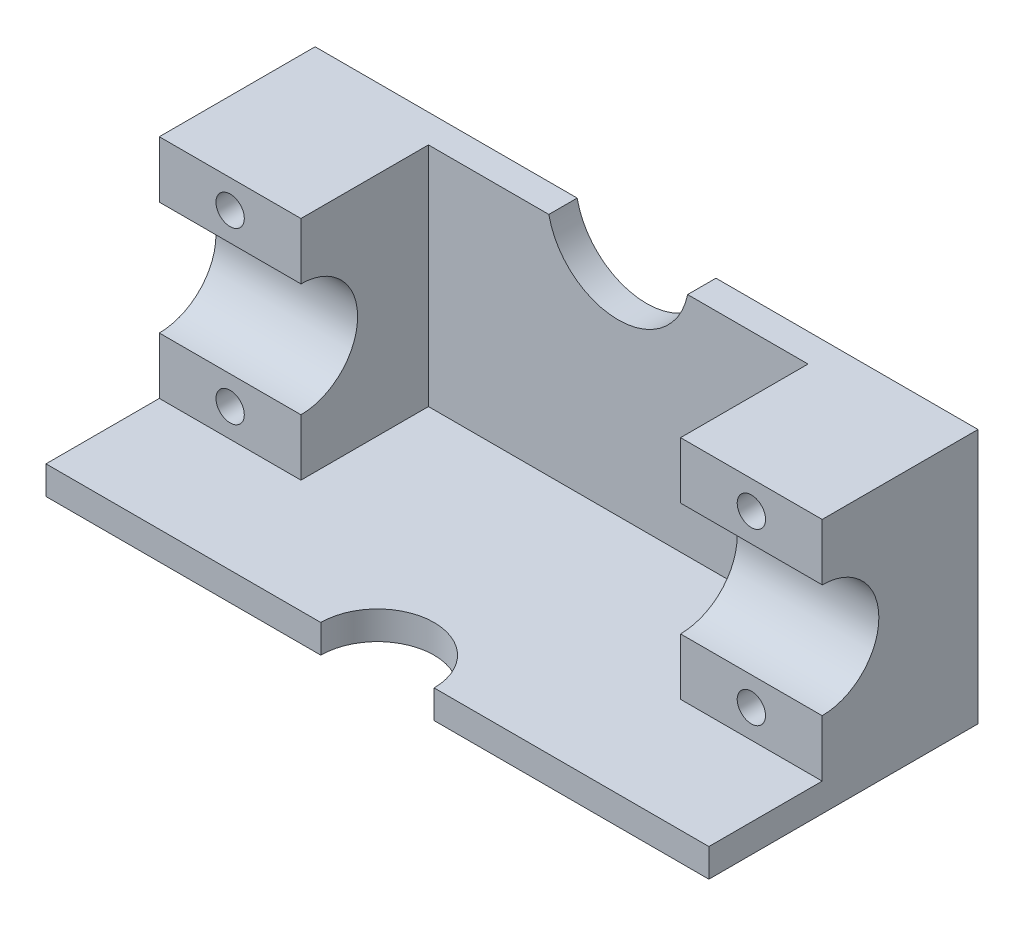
ISO-10303-21;
HEADER;
FILE_DESCRIPTION(('STEP AP214'),'2;1');
FILE_NAME('part.step','',(''),(''),'','','');
FILE_SCHEMA(('AUTOMOTIVE_DESIGN { 1 0 10303 214 1 1 1 1 }'));
ENDSEC;
DATA;
#1=APPLICATION_CONTEXT('core data for automotive mechanical design processes');
#2=APPLICATION_PROTOCOL_DEFINITION('international standard','automotive_design',2000,#1);
#3=PRODUCT_CONTEXT('',#1,'mechanical');
#4=PRODUCT('Part','Part','',(#3));
#5=PRODUCT_RELATED_PRODUCT_CATEGORY('part','',(#4));
#6=PRODUCT_DEFINITION_FORMATION('','',#4);
#7=PRODUCT_DEFINITION_CONTEXT('part definition',#1,'design');
#8=PRODUCT_DEFINITION('design','',#6,#7);
#9=PRODUCT_DEFINITION_SHAPE('','',#8);
#10=(LENGTH_UNIT() NAMED_UNIT(*) SI_UNIT(.MILLI.,.METRE.));
#11=(NAMED_UNIT(*) PLANE_ANGLE_UNIT() SI_UNIT($,.RADIAN.));
#12=(NAMED_UNIT(*) SI_UNIT($,.STERADIAN.) SOLID_ANGLE_UNIT());
#13=UNCERTAINTY_MEASURE_WITH_UNIT(LENGTH_MEASURE(1.E-05),#10,'distance_accuracy_value','');
#14=(GEOMETRIC_REPRESENTATION_CONTEXT(3) GLOBAL_UNCERTAINTY_ASSIGNED_CONTEXT((#13)) GLOBAL_UNIT_ASSIGNED_CONTEXT((#10,
#11,#12)) REPRESENTATION_CONTEXT('',''));
#15=CARTESIAN_POINT('',(0.,0.,0.));
#16=DIRECTION('',(0.,0.,1.));
#17=DIRECTION('',(1.,0.,0.));
#18=AXIS2_PLACEMENT_3D('',#15,#16,#17);
#19=CARTESIAN_POINT('',(-23.4,8.,2.));
#20=DIRECTION('',(1.,0.,0.));
#21=DIRECTION('',(0.,0.,-1.));
#22=AXIS2_PLACEMENT_3D('',#19,#20,#21);
#23=PLANE('',#22);
#24=DIRECTION('',(0.,-1.,0.));
#25=VECTOR('',#24,1.);
#26=CARTESIAN_POINT('',(-23.4,8.,11.));
#27=LINE('',#26,#25);
#28=CARTESIAN_POINT('',(-23.4,8.,11.));
#29=VERTEX_POINT('',#28);
#30=CARTESIAN_POINT('',(-23.4,4.,11.));
#31=VERTEX_POINT('',#30);
#32=EDGE_CURVE('E54',#29,#31,#27,.T.);
#33=ORIENTED_EDGE('',*,*,#32,.F.);
#34=DIRECTION('',(0.,0.,-1.));
#35=VECTOR('',#34,1.);
#36=CARTESIAN_POINT('',(-23.4,8.,2.));
#37=LINE('',#36,#35);
#38=CARTESIAN_POINT('',(-23.4,8.,0.));
#39=VERTEX_POINT('',#38);
#40=EDGE_CURVE('E265',#29,#39,#37,.T.);
#41=ORIENTED_EDGE('',*,*,#40,.T.);
#42=DIRECTION('',(0.,-1.,0.));
#43=VECTOR('',#42,1.);
#44=CARTESIAN_POINT('',(-23.4,8.,0.));
#45=LINE('',#44,#43);
#46=CARTESIAN_POINT('',(-23.4,-10.,0.));
#47=VERTEX_POINT('',#46);
#48=EDGE_CURVE('E253',#39,#47,#45,.T.);
#49=ORIENTED_EDGE('',*,*,#48,.T.);
#50=DIRECTION('',(0.,0.,-1.));
#51=VECTOR('',#50,1.);
#52=CARTESIAN_POINT('',(-23.4,-10.,19.));
#53=LINE('',#52,#51);
#54=CARTESIAN_POINT('',(-23.4,-10.,19.));
#55=VERTEX_POINT('',#54);
#56=EDGE_CURVE('E202',#55,#47,#53,.T.);
#57=ORIENTED_EDGE('',*,*,#56,.F.);
#58=DIRECTION('',(0.,-1.,0.));
#59=VECTOR('',#58,1.);
#60=CARTESIAN_POINT('',(-23.4,8.,19.));
#61=LINE('',#60,#59);
#62=CARTESIAN_POINT('',(-23.4,-8.,19.));
#63=VERTEX_POINT('',#62);
#64=EDGE_CURVE('E180',#63,#55,#61,.T.);
#65=ORIENTED_EDGE('',*,*,#64,.F.);
#66=DIRECTION('',(0.,0.,1.));
#67=VECTOR('',#66,1.);
#68=CARTESIAN_POINT('',(-23.4,-8.,11.));
#69=LINE('',#68,#67);
#70=CARTESIAN_POINT('',(-23.4,-8.,11.));
#71=VERTEX_POINT('',#70);
#72=EDGE_CURVE('E173',#71,#63,#69,.T.);
#73=ORIENTED_EDGE('',*,*,#72,.F.);
#74=CARTESIAN_POINT('',(-23.4,-4.,11.));
#75=VERTEX_POINT('',#74);
#76=EDGE_CURVE('E155',#75,#71,#27,.T.);
#77=ORIENTED_EDGE('',*,*,#76,.F.);
#78=CARTESIAN_POINT('',(-23.4,0.,11.));
#79=DIRECTION('',(-1.,0.,0.));
#80=DIRECTION('',(0.,0.,1.));
#81=AXIS2_PLACEMENT_3D('',#78,#79,#80);
#82=CIRCLE('',#81,4.);
#83=EDGE_CURVE('E227',#31,#75,#82,.T.);
#84=ORIENTED_EDGE('',*,*,#83,.F.);
#85=EDGE_LOOP('',(#33,#41,#49,#57,#65,#73,#77,#84));
#86=FACE_BOUND('',#85,.T.);
#87=ADVANCED_FACE('F33',(#86),#23,.F.);
#88=CARTESIAN_POINT('',(4.89897948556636,8.,2.));
#89=DIRECTION('',(0.,-1.,0.));
#90=DIRECTION('',(1.,0.,0.));
#91=AXIS2_PLACEMENT_3D('',#88,#89,#90);
#92=PLANE('',#91);
#93=DIRECTION('',(-1.,0.,0.));
#94=VECTOR('',#93,1.);
#95=CARTESIAN_POINT('',(13.4,8.,11.));
#96=LINE('',#95,#94);
#97=CARTESIAN_POINT('',(23.4,8.,11.));
#98=VERTEX_POINT('',#97);
#99=CARTESIAN_POINT('',(13.4,8.,11.));
#100=VERTEX_POINT('',#99);
#101=EDGE_CURVE('E198',#98,#100,#96,.T.);
#102=ORIENTED_EDGE('',*,*,#101,.F.);
#103=DIRECTION('',(0.,0.,-1.));
#104=VECTOR('',#103,1.);
#105=CARTESIAN_POINT('',(23.4,8.,2.));
#106=LINE('',#105,#104);
#107=CARTESIAN_POINT('',(23.4,8.,0.));
#108=VERTEX_POINT('',#107);
#109=EDGE_CURVE('E283',#98,#108,#106,.T.);
#110=ORIENTED_EDGE('',*,*,#109,.T.);
#111=DIRECTION('',(-1.,0.,0.));
#112=VECTOR('',#111,1.);
#113=CARTESIAN_POINT('',(4.89897948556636,8.,0.));
#114=LINE('',#113,#112);
#115=CARTESIAN_POINT('',(4.89897948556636,8.,0.));
#116=VERTEX_POINT('',#115);
#117=EDGE_CURVE('E270',#108,#116,#114,.T.);
#118=ORIENTED_EDGE('',*,*,#117,.T.);
#119=DIRECTION('',(0.,0.,-1.));
#120=VECTOR('',#119,1.);
#121=CARTESIAN_POINT('',(4.89897948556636,8.,2.));
#122=LINE('',#121,#120);
#123=CARTESIAN_POINT('',(4.89897948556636,8.,2.));
#124=VERTEX_POINT('',#123);
#125=EDGE_CURVE('E280',#124,#116,#122,.T.);
#126=ORIENTED_EDGE('',*,*,#125,.F.);
#127=DIRECTION('',(-1.,0.,0.));
#128=VECTOR('',#127,1.);
#129=CARTESIAN_POINT('',(4.89897948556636,8.,2.));
#130=LINE('',#129,#128);
#131=CARTESIAN_POINT('',(13.4,8.,2.));
#132=VERTEX_POINT('',#131);
#133=EDGE_CURVE('E257',#132,#124,#130,.T.);
#134=ORIENTED_EDGE('',*,*,#133,.F.);
#135=DIRECTION('',(0.,0.,-1.));
#136=VECTOR('',#135,1.);
#137=CARTESIAN_POINT('',(13.4,8.,19.));
#138=LINE('',#137,#136);
#139=EDGE_CURVE('E244',#100,#132,#138,.T.);
#140=ORIENTED_EDGE('',*,*,#139,.F.);
#141=EDGE_LOOP('',(#102,#110,#118,#126,#134,#140));
#142=FACE_BOUND('',#141,.T.);
#143=ADVANCED_FACE('F312',(#142),#92,.F.);
#144=CARTESIAN_POINT('',(-23.4,8.,2.));
#145=DIRECTION('',(0.,-1.,0.));
#146=DIRECTION('',(1.,0.,0.));
#147=AXIS2_PLACEMENT_3D('',#144,#145,#146);
#148=PLANE('',#147);
#149=DIRECTION('',(-1.,0.,0.));
#150=VECTOR('',#149,1.);
#151=CARTESIAN_POINT('',(-23.4,8.,11.));
#152=LINE('',#151,#150);
#153=CARTESIAN_POINT('',(-13.4,8.,11.));
#154=VERTEX_POINT('',#153);
#155=EDGE_CURVE('E182',#154,#29,#152,.T.);
#156=ORIENTED_EDGE('',*,*,#155,.F.);
#157=DIRECTION('',(0.,0.,-1.));
#158=VECTOR('',#157,1.);
#159=CARTESIAN_POINT('',(-13.4,8.,19.));
#160=LINE('',#159,#158);
#161=CARTESIAN_POINT('',(-13.4,8.,2.));
#162=VERTEX_POINT('',#161);
#163=EDGE_CURVE('E248',#154,#162,#160,.T.);
#164=ORIENTED_EDGE('',*,*,#163,.T.);
#165=DIRECTION('',(-1.,0.,0.));
#166=VECTOR('',#165,1.);
#167=CARTESIAN_POINT('',(-23.4,8.,2.));
#168=LINE('',#167,#166);
#169=CARTESIAN_POINT('',(-4.89897948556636,8.,2.));
#170=VERTEX_POINT('',#169);
#171=EDGE_CURVE('E262',#170,#162,#168,.T.);
#172=ORIENTED_EDGE('',*,*,#171,.F.);
#173=DIRECTION('',(0.,0.,-1.));
#174=VECTOR('',#173,1.);
#175=CARTESIAN_POINT('',(-4.89897948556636,8.,2.));
#176=LINE('',#175,#174);
#177=CARTESIAN_POINT('',(-4.89897948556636,8.,0.));
#178=VERTEX_POINT('',#177);
#179=EDGE_CURVE('E277',#170,#178,#176,.T.);
#180=ORIENTED_EDGE('',*,*,#179,.T.);
#181=DIRECTION('',(-1.,0.,0.));
#182=VECTOR('',#181,1.);
#183=CARTESIAN_POINT('',(-23.4,8.,0.));
#184=LINE('',#183,#182);
#185=EDGE_CURVE('E258',#178,#39,#184,.T.);
#186=ORIENTED_EDGE('',*,*,#185,.T.);
#187=ORIENTED_EDGE('',*,*,#40,.F.);
#188=EDGE_LOOP('',(#156,#164,#172,#180,#186,#187));
#189=FACE_BOUND('',#188,.T.);
#190=ADVANCED_FACE('F345',(#189),#148,.F.);
#191=CARTESIAN_POINT('',(-13.4,8.,19.));
#192=DIRECTION('',(-1.,0.,0.));
#193=DIRECTION('',(0.,-1.,0.));
#194=AXIS2_PLACEMENT_3D('',#191,#192,#193);
#195=PLANE('',#194);
#196=DIRECTION('',(0.,1.,0.));
#197=VECTOR('',#196,1.);
#198=CARTESIAN_POINT('',(-13.4,8.,11.));
#199=LINE('',#198,#197);
#200=CARTESIAN_POINT('',(-13.4,-8.,11.));
#201=VERTEX_POINT('',#200);
#202=CARTESIAN_POINT('',(-13.4,-4.,11.));
#203=VERTEX_POINT('',#202);
#204=EDGE_CURVE('E186',#201,#203,#199,.T.);
#205=ORIENTED_EDGE('',*,*,#204,.F.);
#206=DIRECTION('',(0.,0.,-1.));
#207=VECTOR('',#206,1.);
#208=CARTESIAN_POINT('',(-13.4,-8.,19.));
#209=LINE('',#208,#207);
#210=CARTESIAN_POINT('',(-13.4,-8.,2.));
#211=VERTEX_POINT('',#210);
#212=EDGE_CURVE('E176',#201,#211,#209,.T.);
#213=ORIENTED_EDGE('',*,*,#212,.T.);
#214=DIRECTION('',(0.,1.,0.));
#215=VECTOR('',#214,1.);
#216=CARTESIAN_POINT('',(-13.4,8.,2.));
#217=LINE('',#216,#215);
#218=EDGE_CURVE('E246',#211,#162,#217,.T.);
#219=ORIENTED_EDGE('',*,*,#218,.T.);
#220=ORIENTED_EDGE('',*,*,#163,.F.);
#221=CARTESIAN_POINT('',(-13.4,4.,11.));
#222=VERTEX_POINT('',#221);
#223=EDGE_CURVE('E177',#222,#154,#199,.T.);
#224=ORIENTED_EDGE('',*,*,#223,.F.);
#225=CARTESIAN_POINT('',(-13.4,0.,11.));
#226=DIRECTION('',(-1.,0.,0.));
#227=DIRECTION('',(0.,-1.,0.));
#228=AXIS2_PLACEMENT_3D('',#225,#226,#227);
#229=CIRCLE('',#228,4.);
#230=EDGE_CURVE('E230',#222,#203,#229,.T.);
#231=ORIENTED_EDGE('',*,*,#230,.T.);
#232=EDGE_LOOP('',(#205,#213,#219,#220,#224,#231));
#233=FACE_BOUND('',#232,.T.);
#234=ADVANCED_FACE('F329',(#233),#195,.F.);
#235=CARTESIAN_POINT('',(13.4,8.,19.));
#236=DIRECTION('',(1.,0.,0.));
#237=DIRECTION('',(0.,1.,0.));
#238=AXIS2_PLACEMENT_3D('',#235,#236,#237);
#239=PLANE('',#238);
#240=DIRECTION('',(0.,-1.,0.));
#241=VECTOR('',#240,1.);
#242=CARTESIAN_POINT('',(13.4,8.,11.));
#243=LINE('',#242,#241);
#244=CARTESIAN_POINT('',(13.4,4.,11.));
#245=VERTEX_POINT('',#244);
#246=EDGE_CURVE('E46',#100,#245,#243,.T.);
#247=ORIENTED_EDGE('',*,*,#246,.F.);
#248=ORIENTED_EDGE('',*,*,#139,.T.);
#249=DIRECTION('',(0.,-1.,0.));
#250=VECTOR('',#249,1.);
#251=CARTESIAN_POINT('',(13.4,8.,2.));
#252=LINE('',#251,#250);
#253=CARTESIAN_POINT('',(13.4,-8.,2.));
#254=VERTEX_POINT('',#253);
#255=EDGE_CURVE('E236',#132,#254,#252,.T.);
#256=ORIENTED_EDGE('',*,*,#255,.T.);
#257=DIRECTION('',(0.,0.,-1.));
#258=VECTOR('',#257,1.);
#259=CARTESIAN_POINT('',(13.4,-8.,19.));
#260=LINE('',#259,#258);
#261=CARTESIAN_POINT('',(13.4,-8.,11.));
#262=VERTEX_POINT('',#261);
#263=EDGE_CURVE('E240',#262,#254,#260,.T.);
#264=ORIENTED_EDGE('',*,*,#263,.F.);
#265=CARTESIAN_POINT('',(13.4,-4.,11.));
#266=VERTEX_POINT('',#265);
#267=EDGE_CURVE('E192',#266,#262,#243,.T.);
#268=ORIENTED_EDGE('',*,*,#267,.F.);
#269=CARTESIAN_POINT('',(13.4,0.,11.));
#270=DIRECTION('',(1.,0.,0.));
#271=DIRECTION('',(0.,1.,0.));
#272=AXIS2_PLACEMENT_3D('',#269,#270,#271);
#273=CIRCLE('',#272,4.);
#274=EDGE_CURVE('E229',#266,#245,#273,.T.);
#275=ORIENTED_EDGE('',*,*,#274,.T.);
#276=EDGE_LOOP('',(#247,#248,#256,#264,#268,#275));
#277=FACE_BOUND('',#276,.T.);
#278=ADVANCED_FACE('F300',(#277),#239,.F.);
#279=CARTESIAN_POINT('',(25.6,0.,11.));
#280=DIRECTION('',(-1.,0.,0.));
#281=DIRECTION('',(0.,0.,1.));
#282=AXIS2_PLACEMENT_3D('',#279,#280,#281);
#283=CYLINDRICAL_SURFACE('',#282,4.);
#284=DIRECTION('',(-1.,0.,0.));
#285=VECTOR('',#284,1.);
#286=CARTESIAN_POINT('',(25.6,4.,11.));
#287=LINE('',#286,#285);
#288=CARTESIAN_POINT('',(23.4,4.,11.));
#289=VERTEX_POINT('',#288);
#290=EDGE_CURVE('E11',#245,#289,#287,.F.);
#291=ORIENTED_EDGE('',*,*,#290,.F.);
#292=ORIENTED_EDGE('',*,*,#274,.F.);
#293=DIRECTION('',(-1.,0.,0.));
#294=VECTOR('',#293,1.);
#295=CARTESIAN_POINT('',(25.6,-4.,11.));
#296=LINE('',#295,#294);
#297=CARTESIAN_POINT('',(23.4,-4.,11.));
#298=VERTEX_POINT('',#297);
#299=EDGE_CURVE('E40',#298,#266,#296,.T.);
#300=ORIENTED_EDGE('',*,*,#299,.F.);
#301=CARTESIAN_POINT('',(23.4,0.,11.));
#302=DIRECTION('',(-1.,0.,0.));
#303=DIRECTION('',(0.,0.,1.));
#304=AXIS2_PLACEMENT_3D('',#301,#302,#303);
#305=CIRCLE('',#304,4.);
#306=EDGE_CURVE('E233',#289,#298,#305,.T.);
#307=ORIENTED_EDGE('',*,*,#306,.F.);
#308=EDGE_LOOP('',(#291,#292,#300,#307));
#309=FACE_BOUND('',#308,.T.);
#310=ADVANCED_FACE('F302',(#309),#283,.F.);
#311=DIRECTION('',(-1.,0.,0.));
#312=VECTOR('',#311,1.);
#313=CARTESIAN_POINT('',(25.6,4.,11.));
#314=LINE('',#313,#312);
#315=EDGE_CURVE('E288',#31,#222,#314,.F.);
#316=ORIENTED_EDGE('',*,*,#315,.F.);
#317=ORIENTED_EDGE('',*,*,#83,.T.);
#318=DIRECTION('',(-1.,0.,0.));
#319=VECTOR('',#318,1.);
#320=CARTESIAN_POINT('',(25.6,-4.,11.));
#321=LINE('',#320,#319);
#322=EDGE_CURVE('E161',#203,#75,#321,.T.);
#323=ORIENTED_EDGE('',*,*,#322,.F.);
#324=ORIENTED_EDGE('',*,*,#230,.F.);
#325=EDGE_LOOP('',(#316,#317,#323,#324));
#326=FACE_BOUND('',#325,.T.);
#327=ADVANCED_FACE('F352',(#326),#283,.F.);
#328=CARTESIAN_POINT('',(0.,9.,2.));
#329=DIRECTION('',(0.,0.,1.));
#330=DIRECTION('',(1.,0.,0.));
#331=AXIS2_PLACEMENT_3D('',#328,#329,#330);
#332=PLANE('',#331);
#333=DIRECTION('',(1.,0.,0.));
#334=VECTOR('',#333,1.);
#335=CARTESIAN_POINT('',(-23.4,-8.,2.));
#336=LINE('',#335,#334);
#337=EDGE_CURVE('E254',#211,#254,#336,.T.);
#338=ORIENTED_EDGE('',*,*,#337,.T.);
#339=ORIENTED_EDGE('',*,*,#255,.F.);
#340=ORIENTED_EDGE('',*,*,#133,.T.);
#341=CARTESIAN_POINT('',(0.,9.,2.));
#342=DIRECTION('',(0.,0.,-1.));
#343=DIRECTION('',(1.,0.,0.));
#344=AXIS2_PLACEMENT_3D('',#341,#342,#343);
#345=CIRCLE('',#344,5.);
#346=EDGE_CURVE('E260',#124,#170,#345,.T.);
#347=ORIENTED_EDGE('',*,*,#346,.T.);
#348=ORIENTED_EDGE('',*,*,#171,.T.);
#349=ORIENTED_EDGE('',*,*,#218,.F.);
#350=EDGE_LOOP('',(#338,#339,#340,#347,#348,#349));
#351=FACE_BOUND('',#350,.T.);
#352=ADVANCED_FACE('F318',(#351),#332,.T.);
#353=CARTESIAN_POINT('',(23.4,8.,2.));
#354=DIRECTION('',(-1.,0.,0.));
#355=DIRECTION('',(0.,0.,1.));
#356=AXIS2_PLACEMENT_3D('',#353,#354,#355);
#357=PLANE('',#356);
#358=DIRECTION('',(0.,1.,0.));
#359=VECTOR('',#358,1.);
#360=CARTESIAN_POINT('',(23.4,8.,11.));
#361=LINE('',#360,#359);
#362=CARTESIAN_POINT('',(23.4,-8.,11.));
#363=VERTEX_POINT('',#362);
#364=EDGE_CURVE('E196',#363,#298,#361,.T.);
#365=ORIENTED_EDGE('',*,*,#364,.F.);
#366=DIRECTION('',(0.,0.,1.));
#367=VECTOR('',#366,1.);
#368=CARTESIAN_POINT('',(23.4,-8.,11.));
#369=LINE('',#368,#367);
#370=CARTESIAN_POINT('',(23.4,-8.,19.));
#371=VERTEX_POINT('',#370);
#372=EDGE_CURVE('E166',#363,#371,#369,.T.);
#373=ORIENTED_EDGE('',*,*,#372,.T.);
#374=DIRECTION('',(0.,1.,0.));
#375=VECTOR('',#374,1.);
#376=CARTESIAN_POINT('',(23.4,8.,19.));
#377=LINE('',#376,#375);
#378=CARTESIAN_POINT('',(23.4,-10.,19.));
#379=VERTEX_POINT('',#378);
#380=EDGE_CURVE('E237',#379,#371,#377,.T.);
#381=ORIENTED_EDGE('',*,*,#380,.F.);
#382=DIRECTION('',(0.,0.,1.));
#383=VECTOR('',#382,1.);
#384=CARTESIAN_POINT('',(23.4,-10.,19.));
#385=LINE('',#384,#383);
#386=CARTESIAN_POINT('',(23.4,-10.,0.));
#387=VERTEX_POINT('',#386);
#388=EDGE_CURVE('E209',#387,#379,#385,.T.);
#389=ORIENTED_EDGE('',*,*,#388,.F.);
#390=DIRECTION('',(0.,1.,0.));
#391=VECTOR('',#390,1.);
#392=CARTESIAN_POINT('',(23.4,8.,0.));
#393=LINE('',#392,#391);
#394=EDGE_CURVE('E267',#387,#108,#393,.T.);
#395=ORIENTED_EDGE('',*,*,#394,.T.);
#396=ORIENTED_EDGE('',*,*,#109,.F.);
#397=EDGE_CURVE('E195',#289,#98,#361,.T.);
#398=ORIENTED_EDGE('',*,*,#397,.F.);
#399=ORIENTED_EDGE('',*,*,#306,.T.);
#400=EDGE_LOOP('',(#365,#373,#381,#389,#395,#396,#398,#399));
#401=FACE_BOUND('',#400,.T.);
#402=ADVANCED_FACE('F308',(#401),#357,.F.);
#403=CARTESIAN_POINT('',(0.,9.,2.));
#404=DIRECTION('',(0.,0.,-1.));
#405=DIRECTION('',(-1.,0.,0.));
#406=AXIS2_PLACEMENT_3D('',#403,#404,#405);
#407=CYLINDRICAL_SURFACE('',#406,5.);
#408=CARTESIAN_POINT('',(0.,9.,0.));
#409=DIRECTION('',(0.,0.,-1.));
#410=DIRECTION('',(1.,0.,0.));
#411=AXIS2_PLACEMENT_3D('',#408,#409,#410);
#412=CIRCLE('',#411,5.);
#413=EDGE_CURVE('E272',#116,#178,#412,.T.);
#414=ORIENTED_EDGE('',*,*,#413,.T.);
#415=ORIENTED_EDGE('',*,*,#179,.F.);
#416=ORIENTED_EDGE('',*,*,#346,.F.);
#417=ORIENTED_EDGE('',*,*,#125,.T.);
#418=EDGE_LOOP('',(#414,#415,#416,#417));
#419=FACE_BOUND('',#418,.T.);
#420=ADVANCED_FACE('F324',(#419),#407,.F.);
#421=CARTESIAN_POINT('',(0.,9.,0.));
#422=DIRECTION('',(0.,0.,1.));
#423=DIRECTION('',(1.,0.,0.));
#424=AXIS2_PLACEMENT_3D('',#421,#422,#423);
#425=PLANE('',#424);
#426=CARTESIAN_POINT('',(18.4,6.,0.));
#427=DIRECTION('',(0.,0.,1.));
#428=DIRECTION('',(1.,0.,0.));
#429=AXIS2_PLACEMENT_3D('',#426,#427,#428);
#430=CIRCLE('',#429,1.);
#431=CARTESIAN_POINT('',(19.4,6.,0.));
#432=VERTEX_POINT('',#431);
#433=EDGE_CURVE('E440',#432,#432,#430,.T.);
#434=ORIENTED_EDGE('',*,*,#433,.T.);
#435=EDGE_LOOP('',(#434));
#436=FACE_BOUND('',#435,.T.);
#437=CARTESIAN_POINT('',(18.4,-6.,0.));
#438=DIRECTION('',(0.,0.,1.));
#439=DIRECTION('',(1.,0.,0.));
#440=AXIS2_PLACEMENT_3D('',#437,#438,#439);
#441=CIRCLE('',#440,1.);
#442=CARTESIAN_POINT('',(19.4,-6.,0.));
#443=VERTEX_POINT('',#442);
#444=EDGE_CURVE('E301',#443,#443,#441,.T.);
#445=ORIENTED_EDGE('',*,*,#444,.T.);
#446=EDGE_LOOP('',(#445));
#447=FACE_BOUND('',#446,.T.);
#448=CARTESIAN_POINT('',(-18.4,-6.,0.));
#449=DIRECTION('',(0.,0.,1.));
#450=DIRECTION('',(1.,0.,0.));
#451=AXIS2_PLACEMENT_3D('',#448,#449,#450);
#452=CIRCLE('',#451,1.);
#453=CARTESIAN_POINT('',(-17.4,-6.,0.));
#454=VERTEX_POINT('',#453);
#455=EDGE_CURVE('E435',#454,#454,#452,.T.);
#456=ORIENTED_EDGE('',*,*,#455,.T.);
#457=EDGE_LOOP('',(#456));
#458=FACE_BOUND('',#457,.T.);
#459=CARTESIAN_POINT('',(-18.4,6.,0.));
#460=DIRECTION('',(0.,0.,1.));
#461=DIRECTION('',(1.,0.,0.));
#462=AXIS2_PLACEMENT_3D('',#459,#460,#461);
#463=CIRCLE('',#462,1.);
#464=CARTESIAN_POINT('',(-17.4,6.,0.));
#465=VERTEX_POINT('',#464);
#466=EDGE_CURVE('E437',#465,#465,#463,.T.);
#467=ORIENTED_EDGE('',*,*,#466,.T.);
#468=EDGE_LOOP('',(#467));
#469=FACE_BOUND('',#468,.T.);
#470=ORIENTED_EDGE('',*,*,#48,.F.);
#471=ORIENTED_EDGE('',*,*,#185,.F.);
#472=ORIENTED_EDGE('',*,*,#413,.F.);
#473=ORIENTED_EDGE('',*,*,#117,.F.);
#474=ORIENTED_EDGE('',*,*,#394,.F.);
#475=DIRECTION('',(1.,0.,0.));
#476=VECTOR('',#475,1.);
#477=CARTESIAN_POINT('',(-23.4,-10.,0.));
#478=LINE('',#477,#476);
#479=EDGE_CURVE('E205',#47,#387,#478,.T.);
#480=ORIENTED_EDGE('',*,*,#479,.F.);
#481=EDGE_LOOP('',(#470,#471,#472,#473,#474,#480));
#482=FACE_BOUND('',#481,.T.);
#483=ADVANCED_FACE('F342',(#436,#447,#458,#469,#482),#425,.F.);
#484=CARTESIAN_POINT('',(0.,0.,19.));
#485=DIRECTION('',(0.,0.,1.));
#486=DIRECTION('',(1.,0.,0.));
#487=AXIS2_PLACEMENT_3D('',#484,#485,#486);
#488=PLANE('',#487);
#489=DIRECTION('',(-1.,0.,0.));
#490=VECTOR('',#489,1.);
#491=CARTESIAN_POINT('',(-23.4,-8.,19.));
#492=LINE('',#491,#490);
#493=CARTESIAN_POINT('',(-4.,-8.,19.));
#494=VERTEX_POINT('',#493);
#495=EDGE_CURVE('E206',#494,#63,#492,.T.);
#496=ORIENTED_EDGE('',*,*,#495,.T.);
#497=ORIENTED_EDGE('',*,*,#64,.T.);
#498=DIRECTION('',(-1.,0.,0.));
#499=VECTOR('',#498,1.);
#500=CARTESIAN_POINT('',(-23.4,-10.,19.));
#501=LINE('',#500,#499);
#502=CARTESIAN_POINT('',(-4.,-10.,19.));
#503=VERTEX_POINT('',#502);
#504=EDGE_CURVE('E216',#503,#55,#501,.T.);
#505=ORIENTED_EDGE('',*,*,#504,.F.);
#506=DIRECTION('',(0.,1.,0.));
#507=VECTOR('',#506,1.);
#508=CARTESIAN_POINT('',(-4.,-10.,19.));
#509=LINE('',#508,#507);
#510=EDGE_CURVE('E218',#503,#494,#509,.T.);
#511=ORIENTED_EDGE('',*,*,#510,.T.);
#512=EDGE_LOOP('',(#496,#497,#505,#511));
#513=FACE_BOUND('',#512,.T.);
#514=ADVANCED_FACE('F379',(#513),#488,.T.);
#515=CARTESIAN_POINT('',(0.,0.,19.));
#516=DIRECTION('',(0.,0.,1.));
#517=DIRECTION('',(1.,0.,0.));
#518=AXIS2_PLACEMENT_3D('',#515,#516,#517);
#519=PLANE('',#518);
#520=ORIENTED_EDGE('',*,*,#380,.T.);
#521=DIRECTION('',(-1.,0.,0.));
#522=VECTOR('',#521,1.);
#523=CARTESIAN_POINT('',(4.,-8.,19.));
#524=LINE('',#523,#522);
#525=CARTESIAN_POINT('',(4.,-8.,19.));
#526=VERTEX_POINT('',#525);
#527=EDGE_CURVE('E181',#371,#526,#524,.T.);
#528=ORIENTED_EDGE('',*,*,#527,.T.);
#529=DIRECTION('',(0.,1.,0.));
#530=VECTOR('',#529,1.);
#531=CARTESIAN_POINT('',(4.,-10.,19.));
#532=LINE('',#531,#530);
#533=CARTESIAN_POINT('',(4.,-10.,19.));
#534=VERTEX_POINT('',#533);
#535=EDGE_CURVE('E224',#534,#526,#532,.T.);
#536=ORIENTED_EDGE('',*,*,#535,.F.);
#537=DIRECTION('',(-1.,0.,0.));
#538=VECTOR('',#537,1.);
#539=CARTESIAN_POINT('',(4.,-10.,19.));
#540=LINE('',#539,#538);
#541=EDGE_CURVE('E212',#379,#534,#540,.T.);
#542=ORIENTED_EDGE('',*,*,#541,.F.);
#543=EDGE_LOOP('',(#520,#528,#536,#542));
#544=FACE_BOUND('',#543,.T.);
#545=ADVANCED_FACE('F333',(#544),#519,.T.);
#546=CARTESIAN_POINT('',(0.,-8.,19.));
#547=DIRECTION('',(0.,-1.,0.));
#548=DIRECTION('',(1.,0.,0.));
#549=AXIS2_PLACEMENT_3D('',#546,#547,#548);
#550=PLANE('',#549);
#551=ORIENTED_EDGE('',*,*,#527,.F.);
#552=ORIENTED_EDGE('',*,*,#372,.F.);
#553=DIRECTION('',(1.,0.,0.));
#554=VECTOR('',#553,1.);
#555=CARTESIAN_POINT('',(13.4,-8.,11.));
#556=LINE('',#555,#554);
#557=EDGE_CURVE('E191',#262,#363,#556,.T.);
#558=ORIENTED_EDGE('',*,*,#557,.F.);
#559=ORIENTED_EDGE('',*,*,#263,.T.);
#560=ORIENTED_EDGE('',*,*,#337,.F.);
#561=ORIENTED_EDGE('',*,*,#212,.F.);
#562=DIRECTION('',(1.,0.,0.));
#563=VECTOR('',#562,1.);
#564=CARTESIAN_POINT('',(-23.4,-8.,11.));
#565=LINE('',#564,#563);
#566=EDGE_CURVE('E158',#71,#201,#565,.T.);
#567=ORIENTED_EDGE('',*,*,#566,.F.);
#568=ORIENTED_EDGE('',*,*,#72,.T.);
#569=ORIENTED_EDGE('',*,*,#495,.F.);
#570=CARTESIAN_POINT('',(0.,-8.,19.));
#571=DIRECTION('',(0.,1.,0.));
#572=DIRECTION('',(1.,0.,0.));
#573=AXIS2_PLACEMENT_3D('',#570,#571,#572);
#574=CIRCLE('',#573,4.);
#575=EDGE_CURVE('E184',#526,#494,#574,.T.);
#576=ORIENTED_EDGE('',*,*,#575,.F.);
#577=EDGE_LOOP('',(#551,#552,#558,#559,#560,#561,#567,#568,#569,#576));
#578=FACE_BOUND('',#577,.T.);
#579=ADVANCED_FACE('F171',(#578),#550,.F.);
#580=CARTESIAN_POINT('',(0.,-10.,19.));
#581=DIRECTION('',(0.,1.,0.));
#582=DIRECTION('',(-1.,0.,0.));
#583=AXIS2_PLACEMENT_3D('',#580,#581,#582);
#584=CYLINDRICAL_SURFACE('',#583,4.);
#585=ORIENTED_EDGE('',*,*,#575,.T.);
#586=ORIENTED_EDGE('',*,*,#510,.F.);
#587=CARTESIAN_POINT('',(0.,-10.,19.));
#588=DIRECTION('',(0.,1.,0.));
#589=DIRECTION('',(1.,0.,0.));
#590=AXIS2_PLACEMENT_3D('',#587,#588,#589);
#591=CIRCLE('',#590,4.);
#592=EDGE_CURVE('E214',#534,#503,#591,.T.);
#593=ORIENTED_EDGE('',*,*,#592,.F.);
#594=ORIENTED_EDGE('',*,*,#535,.T.);
#595=EDGE_LOOP('',(#585,#586,#593,#594));
#596=FACE_BOUND('',#595,.T.);
#597=ADVANCED_FACE('F397',(#596),#584,.F.);
#598=CARTESIAN_POINT('',(0.,-10.,19.));
#599=DIRECTION('',(0.,-1.,0.));
#600=DIRECTION('',(1.,0.,0.));
#601=AXIS2_PLACEMENT_3D('',#598,#599,#600);
#602=PLANE('',#601);
#603=ORIENTED_EDGE('',*,*,#56,.T.);
#604=ORIENTED_EDGE('',*,*,#479,.T.);
#605=ORIENTED_EDGE('',*,*,#388,.T.);
#606=ORIENTED_EDGE('',*,*,#541,.T.);
#607=ORIENTED_EDGE('',*,*,#592,.T.);
#608=ORIENTED_EDGE('',*,*,#504,.T.);
#609=EDGE_LOOP('',(#603,#604,#605,#606,#607,#608));
#610=FACE_BOUND('',#609,.T.);
#611=ADVANCED_FACE('F337',(#610),#602,.T.);
#612=CARTESIAN_POINT('',(0.,0.,11.));
#613=DIRECTION('',(0.,0.,1.));
#614=DIRECTION('',(1.,0.,0.));
#615=AXIS2_PLACEMENT_3D('',#612,#613,#614);
#616=PLANE('',#615);
#617=CARTESIAN_POINT('',(18.4,-6.,11.));
#618=DIRECTION('',(0.,0.,1.));
#619=DIRECTION('',(-1.,0.,0.));
#620=AXIS2_PLACEMENT_3D('',#617,#618,#619);
#621=CIRCLE('',#620,1.);
#622=CARTESIAN_POINT('',(19.4,-6.,11.));
#623=VERTEX_POINT('',#622);
#624=EDGE_CURVE('E450',#623,#623,#621,.T.);
#625=ORIENTED_EDGE('',*,*,#624,.F.);
#626=EDGE_LOOP('',(#625));
#627=FACE_BOUND('',#626,.T.);
#628=ORIENTED_EDGE('',*,*,#299,.T.);
#629=ORIENTED_EDGE('',*,*,#267,.T.);
#630=ORIENTED_EDGE('',*,*,#557,.T.);
#631=ORIENTED_EDGE('',*,*,#364,.T.);
#632=EDGE_LOOP('',(#628,#629,#630,#631));
#633=FACE_BOUND('',#632,.T.);
#634=ADVANCED_FACE('F293',(#627,#633),#616,.T.);
#635=CARTESIAN_POINT('',(0.,0.,11.));
#636=DIRECTION('',(0.,0.,1.));
#637=DIRECTION('',(1.,0.,0.));
#638=AXIS2_PLACEMENT_3D('',#635,#636,#637);
#639=PLANE('',#638);
#640=CARTESIAN_POINT('',(-18.4,-6.,11.));
#641=DIRECTION('',(0.,0.,1.));
#642=DIRECTION('',(1.,0.,0.));
#643=AXIS2_PLACEMENT_3D('',#640,#641,#642);
#644=CIRCLE('',#643,1.);
#645=CARTESIAN_POINT('',(-17.4,-6.,11.));
#646=VERTEX_POINT('',#645);
#647=EDGE_CURVE('E432',#646,#646,#644,.T.);
#648=ORIENTED_EDGE('',*,*,#647,.F.);
#649=EDGE_LOOP('',(#648));
#650=FACE_BOUND('',#649,.T.);
#651=ORIENTED_EDGE('',*,*,#322,.T.);
#652=ORIENTED_EDGE('',*,*,#76,.T.);
#653=ORIENTED_EDGE('',*,*,#566,.T.);
#654=ORIENTED_EDGE('',*,*,#204,.T.);
#655=EDGE_LOOP('',(#651,#652,#653,#654));
#656=FACE_BOUND('',#655,.T.);
#657=ADVANCED_FACE('F157',(#650,#656),#639,.T.);
#658=CARTESIAN_POINT('',(-18.4,6.,11.));
#659=DIRECTION('',(0.,0.,1.));
#660=DIRECTION('',(1.,0.,0.));
#661=AXIS2_PLACEMENT_3D('',#658,#659,#660);
#662=CIRCLE('',#661,1.);
#663=CARTESIAN_POINT('',(-17.4,6.,11.));
#664=VERTEX_POINT('',#663);
#665=EDGE_CURVE('E444',#664,#664,#662,.T.);
#666=ORIENTED_EDGE('',*,*,#665,.F.);
#667=EDGE_LOOP('',(#666));
#668=FACE_BOUND('',#667,.T.);
#669=ORIENTED_EDGE('',*,*,#315,.T.);
#670=ORIENTED_EDGE('',*,*,#223,.T.);
#671=ORIENTED_EDGE('',*,*,#155,.T.);
#672=ORIENTED_EDGE('',*,*,#32,.T.);
#673=EDGE_LOOP('',(#669,#670,#671,#672));
#674=FACE_BOUND('',#673,.T.);
#675=ADVANCED_FACE('F349',(#668,#674),#639,.T.);
#676=CARTESIAN_POINT('',(18.4,6.,11.));
#677=DIRECTION('',(0.,0.,1.));
#678=DIRECTION('',(-1.,0.,0.));
#679=AXIS2_PLACEMENT_3D('',#676,#677,#678);
#680=CIRCLE('',#679,1.);
#681=CARTESIAN_POINT('',(19.4,6.,11.));
#682=VERTEX_POINT('',#681);
#683=EDGE_CURVE('E447',#682,#682,#680,.T.);
#684=ORIENTED_EDGE('',*,*,#683,.F.);
#685=EDGE_LOOP('',(#684));
#686=FACE_BOUND('',#685,.T.);
#687=ORIENTED_EDGE('',*,*,#290,.T.);
#688=ORIENTED_EDGE('',*,*,#397,.T.);
#689=ORIENTED_EDGE('',*,*,#101,.T.);
#690=ORIENTED_EDGE('',*,*,#246,.T.);
#691=EDGE_LOOP('',(#687,#688,#689,#690));
#692=FACE_BOUND('',#691,.T.);
#693=ADVANCED_FACE('F304',(#686,#692),#616,.T.);
#694=CARTESIAN_POINT('',(18.4,6.,-2.));
#695=DIRECTION('',(0.,0.,1.));
#696=DIRECTION('',(1.,0.,0.));
#697=AXIS2_PLACEMENT_3D('',#694,#695,#696);
#698=CYLINDRICAL_SURFACE('',#697,1.);
#699=CARTESIAN_POINT('',(19.4,6.,11.));
#700=CARTESIAN_POINT('',(19.4,6.,10.8854166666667));
#701=CARTESIAN_POINT('',(19.4,6.,10.7708333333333));
#702=CARTESIAN_POINT('',(19.4,6.,10.5416666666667));
#703=CARTESIAN_POINT('',(19.4,6.,10.4270833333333));
#704=CARTESIAN_POINT('',(19.4,6.,10.1979166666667));
#705=CARTESIAN_POINT('',(19.4,6.,10.0833333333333));
#706=CARTESIAN_POINT('',(19.4,6.,9.85416666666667));
#707=CARTESIAN_POINT('',(19.4,6.,9.73958333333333));
#708=CARTESIAN_POINT('',(19.4,6.,9.51041666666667));
#709=CARTESIAN_POINT('',(19.4,6.,9.39583333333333));
#710=CARTESIAN_POINT('',(19.4,6.,9.16666666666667));
#711=CARTESIAN_POINT('',(19.4,6.,9.05208333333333));
#712=CARTESIAN_POINT('',(19.4,6.,8.82291666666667));
#713=CARTESIAN_POINT('',(19.4,6.,8.70833333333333));
#714=CARTESIAN_POINT('',(19.4,6.,8.47916666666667));
#715=CARTESIAN_POINT('',(19.4,6.,8.36458333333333));
#716=CARTESIAN_POINT('',(19.4,6.,8.13541666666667));
#717=CARTESIAN_POINT('',(19.4,6.,8.02083333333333));
#718=CARTESIAN_POINT('',(19.4,6.,7.79166666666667));
#719=CARTESIAN_POINT('',(19.4,6.,7.67708333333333));
#720=CARTESIAN_POINT('',(19.4,6.,7.44791666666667));
#721=CARTESIAN_POINT('',(19.4,6.,7.33333333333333));
#722=CARTESIAN_POINT('',(19.4,6.,7.10416666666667));
#723=CARTESIAN_POINT('',(19.4,6.,6.98958333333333));
#724=CARTESIAN_POINT('',(19.4,6.,6.76041666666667));
#725=CARTESIAN_POINT('',(19.4,6.,6.64583333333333));
#726=CARTESIAN_POINT('',(19.4,6.,6.41666666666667));
#727=CARTESIAN_POINT('',(19.4,6.,6.30208333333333));
#728=CARTESIAN_POINT('',(19.4,6.,6.07291666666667));
#729=CARTESIAN_POINT('',(19.4,6.,5.95833333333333));
#730=CARTESIAN_POINT('',(19.4,6.,5.72916666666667));
#731=CARTESIAN_POINT('',(19.4,6.,5.61458333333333));
#732=CARTESIAN_POINT('',(19.4,6.,5.38541666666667));
#733=CARTESIAN_POINT('',(19.4,6.,5.27083333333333));
#734=CARTESIAN_POINT('',(19.4,6.,5.04166666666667));
#735=CARTESIAN_POINT('',(19.4,6.,4.92708333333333));
#736=CARTESIAN_POINT('',(19.4,6.,4.69791666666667));
#737=CARTESIAN_POINT('',(19.4,6.,4.58333333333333));
#738=CARTESIAN_POINT('',(19.4,6.,4.35416666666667));
#739=CARTESIAN_POINT('',(19.4,6.,4.23958333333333));
#740=CARTESIAN_POINT('',(19.4,6.,4.01041666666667));
#741=CARTESIAN_POINT('',(19.4,6.,3.89583333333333));
#742=CARTESIAN_POINT('',(19.4,6.,3.66666666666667));
#743=CARTESIAN_POINT('',(19.4,6.,3.55208333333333));
#744=CARTESIAN_POINT('',(19.4,6.,3.32291666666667));
#745=CARTESIAN_POINT('',(19.4,6.,3.20833333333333));
#746=CARTESIAN_POINT('',(19.4,6.,2.97916666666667));
#747=CARTESIAN_POINT('',(19.4,6.,2.86458333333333));
#748=CARTESIAN_POINT('',(19.4,6.,2.63541666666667));
#749=CARTESIAN_POINT('',(19.4,6.,2.52083333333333));
#750=CARTESIAN_POINT('',(19.4,6.,2.29166666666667));
#751=CARTESIAN_POINT('',(19.4,6.,2.17708333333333));
#752=CARTESIAN_POINT('',(19.4,6.,1.94791666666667));
#753=CARTESIAN_POINT('',(19.4,6.,1.83333333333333));
#754=CARTESIAN_POINT('',(19.4,6.,1.60416666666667));
#755=CARTESIAN_POINT('',(19.4,6.,1.48958333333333));
#756=CARTESIAN_POINT('',(19.4,6.,1.26041666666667));
#757=CARTESIAN_POINT('',(19.4,6.,1.14583333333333));
#758=CARTESIAN_POINT('',(19.4,6.,0.916666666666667));
#759=CARTESIAN_POINT('',(19.4,6.,0.802083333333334));
#760=CARTESIAN_POINT('',(19.4,6.,0.572916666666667));
#761=CARTESIAN_POINT('',(19.4,6.,0.458333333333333));
#762=CARTESIAN_POINT('',(19.4,6.,0.229166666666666));
#763=CARTESIAN_POINT('',(19.4,6.,0.114583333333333));
#764=CARTESIAN_POINT('',(19.4,6.,0.));
#765=B_SPLINE_CURVE_WITH_KNOTS('',3,(#699,#700,#701,#702,#703,#704,#705,#706,#707,#708,#709,
#710,#711,#712,#713,#714,#715,#716,#717,#718,#719,#720,#721,#722,#723,#724,#725,#726,#727,#728,
#729,#730,#731,#732,#733,#734,#735,#736,#737,#738,#739,#740,#741,#742,#743,#744,#745,#746,#747,
#748,#749,#750,#751,#752,#753,#754,#755,#756,#757,#758,#759,#760,#761,#762,#763,#764),
.UNSPECIFIED.,.F.,.F.,(4,2,2,2,2,2,2,2,2,2,2,2,2,2,2,2,2,2,2,2,2,2,2,2,2,2,2,2,2,2,2,2,4),(0.,
0.34375,0.687500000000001,1.03125,1.375,1.71875,2.0625,2.40625,2.75,3.09375,3.4375,3.78125,
4.125,4.46875,4.8125,5.15625,5.5,5.84375,6.1875,6.53125,6.875,7.21875,7.5625,7.90625,8.25,
8.59375,8.9375,9.28125,9.625,9.96875,10.3125,10.65625,11.),.UNSPECIFIED.);
#766=EDGE_CURVE('BSEAM408',#682,#432,#765,.T.);
#767=ORIENTED_EDGE('',*,*,#683,.T.);
#768=ORIENTED_EDGE('',*,*,#433,.F.);
#769=ORIENTED_EDGE('',*,*,#766,.T.);
#770=ORIENTED_EDGE('',*,*,#766,.F.);
#771=EDGE_LOOP('',(#767,#769,#768,#770));
#772=FACE_BOUND('',#771,.T.);
#773=ADVANCED_FACE('F408',(#772),#698,.F.);
#774=CARTESIAN_POINT('',(-18.4,6.,-2.));
#775=DIRECTION('',(0.,0.,1.));
#776=DIRECTION('',(1.,0.,0.));
#777=AXIS2_PLACEMENT_3D('',#774,#775,#776);
#778=CYLINDRICAL_SURFACE('',#777,1.);
#779=CARTESIAN_POINT('',(-17.4,6.,11.));
#780=CARTESIAN_POINT('',(-17.4,6.,10.8854166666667));
#781=CARTESIAN_POINT('',(-17.4,6.,10.7708333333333));
#782=CARTESIAN_POINT('',(-17.4,6.,10.5416666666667));
#783=CARTESIAN_POINT('',(-17.4,6.,10.4270833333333));
#784=CARTESIAN_POINT('',(-17.4,6.,10.1979166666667));
#785=CARTESIAN_POINT('',(-17.4,6.,10.0833333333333));
#786=CARTESIAN_POINT('',(-17.4,6.,9.85416666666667));
#787=CARTESIAN_POINT('',(-17.4,6.,9.73958333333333));
#788=CARTESIAN_POINT('',(-17.4,6.,9.51041666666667));
#789=CARTESIAN_POINT('',(-17.4,6.,9.39583333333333));
#790=CARTESIAN_POINT('',(-17.4,6.,9.16666666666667));
#791=CARTESIAN_POINT('',(-17.4,6.,9.05208333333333));
#792=CARTESIAN_POINT('',(-17.4,6.,8.82291666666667));
#793=CARTESIAN_POINT('',(-17.4,6.,8.70833333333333));
#794=CARTESIAN_POINT('',(-17.4,6.,8.47916666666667));
#795=CARTESIAN_POINT('',(-17.4,6.,8.36458333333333));
#796=CARTESIAN_POINT('',(-17.4,6.,8.13541666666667));
#797=CARTESIAN_POINT('',(-17.4,6.,8.02083333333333));
#798=CARTESIAN_POINT('',(-17.4,6.,7.79166666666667));
#799=CARTESIAN_POINT('',(-17.4,6.,7.67708333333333));
#800=CARTESIAN_POINT('',(-17.4,6.,7.44791666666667));
#801=CARTESIAN_POINT('',(-17.4,6.,7.33333333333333));
#802=CARTESIAN_POINT('',(-17.4,6.,7.10416666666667));
#803=CARTESIAN_POINT('',(-17.4,6.,6.98958333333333));
#804=CARTESIAN_POINT('',(-17.4,6.,6.76041666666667));
#805=CARTESIAN_POINT('',(-17.4,6.,6.64583333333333));
#806=CARTESIAN_POINT('',(-17.4,6.,6.41666666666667));
#807=CARTESIAN_POINT('',(-17.4,6.,6.30208333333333));
#808=CARTESIAN_POINT('',(-17.4,6.,6.07291666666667));
#809=CARTESIAN_POINT('',(-17.4,6.,5.95833333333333));
#810=CARTESIAN_POINT('',(-17.4,6.,5.72916666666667));
#811=CARTESIAN_POINT('',(-17.4,6.,5.61458333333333));
#812=CARTESIAN_POINT('',(-17.4,6.,5.38541666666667));
#813=CARTESIAN_POINT('',(-17.4,6.,5.27083333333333));
#814=CARTESIAN_POINT('',(-17.4,6.,5.04166666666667));
#815=CARTESIAN_POINT('',(-17.4,6.,4.92708333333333));
#816=CARTESIAN_POINT('',(-17.4,6.,4.69791666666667));
#817=CARTESIAN_POINT('',(-17.4,6.,4.58333333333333));
#818=CARTESIAN_POINT('',(-17.4,6.,4.35416666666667));
#819=CARTESIAN_POINT('',(-17.4,6.,4.23958333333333));
#820=CARTESIAN_POINT('',(-17.4,6.,4.01041666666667));
#821=CARTESIAN_POINT('',(-17.4,6.,3.89583333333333));
#822=CARTESIAN_POINT('',(-17.4,6.,3.66666666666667));
#823=CARTESIAN_POINT('',(-17.4,6.,3.55208333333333));
#824=CARTESIAN_POINT('',(-17.4,6.,3.32291666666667));
#825=CARTESIAN_POINT('',(-17.4,6.,3.20833333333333));
#826=CARTESIAN_POINT('',(-17.4,6.,2.97916666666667));
#827=CARTESIAN_POINT('',(-17.4,6.,2.86458333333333));
#828=CARTESIAN_POINT('',(-17.4,6.,2.63541666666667));
#829=CARTESIAN_POINT('',(-17.4,6.,2.52083333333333));
#830=CARTESIAN_POINT('',(-17.4,6.,2.29166666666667));
#831=CARTESIAN_POINT('',(-17.4,6.,2.17708333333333));
#832=CARTESIAN_POINT('',(-17.4,6.,1.94791666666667));
#833=CARTESIAN_POINT('',(-17.4,6.,1.83333333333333));
#834=CARTESIAN_POINT('',(-17.4,6.,1.60416666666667));
#835=CARTESIAN_POINT('',(-17.4,6.,1.48958333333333));
#836=CARTESIAN_POINT('',(-17.4,6.,1.26041666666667));
#837=CARTESIAN_POINT('',(-17.4,6.,1.14583333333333));
#838=CARTESIAN_POINT('',(-17.4,6.,0.916666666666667));
#839=CARTESIAN_POINT('',(-17.4,6.,0.802083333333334));
#840=CARTESIAN_POINT('',(-17.4,6.,0.572916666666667));
#841=CARTESIAN_POINT('',(-17.4,6.,0.458333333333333));
#842=CARTESIAN_POINT('',(-17.4,6.,0.229166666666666));
#843=CARTESIAN_POINT('',(-17.4,6.,0.114583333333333));
#844=CARTESIAN_POINT('',(-17.4,6.,0.));
#845=B_SPLINE_CURVE_WITH_KNOTS('',3,(#779,#780,#781,#782,#783,#784,#785,#786,#787,#788,#789,
#790,#791,#792,#793,#794,#795,#796,#797,#798,#799,#800,#801,#802,#803,#804,#805,#806,#807,#808,
#809,#810,#811,#812,#813,#814,#815,#816,#817,#818,#819,#820,#821,#822,#823,#824,#825,#826,#827,
#828,#829,#830,#831,#832,#833,#834,#835,#836,#837,#838,#839,#840,#841,#842,#843,#844),
.UNSPECIFIED.,.F.,.F.,(4,2,2,2,2,2,2,2,2,2,2,2,2,2,2,2,2,2,2,2,2,2,2,2,2,2,2,2,2,2,2,2,4),(0.,
0.34375,0.687500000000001,1.03125,1.375,1.71875,2.0625,2.40625,2.75,3.09375,3.4375,3.78125,
4.125,4.46875,4.8125,5.15625,5.5,5.84375,6.1875,6.53125,6.875,7.21875,7.5625,7.90625,8.25,
8.59375,8.9375,9.28125,9.625,9.96875,10.3125,10.65625,11.),.UNSPECIFIED.);
#846=EDGE_CURVE('BSEAM413',#664,#465,#845,.T.);
#847=ORIENTED_EDGE('',*,*,#665,.T.);
#848=ORIENTED_EDGE('',*,*,#466,.F.);
#849=ORIENTED_EDGE('',*,*,#846,.T.);
#850=ORIENTED_EDGE('',*,*,#846,.F.);
#851=EDGE_LOOP('',(#847,#849,#848,#850));
#852=FACE_BOUND('',#851,.T.);
#853=ADVANCED_FACE('F413',(#852),#778,.F.);
#854=CARTESIAN_POINT('',(-18.4,-6.,-2.));
#855=DIRECTION('',(0.,0.,1.));
#856=DIRECTION('',(1.,0.,0.));
#857=AXIS2_PLACEMENT_3D('',#854,#855,#856);
#858=CYLINDRICAL_SURFACE('',#857,1.);
#859=CARTESIAN_POINT('',(-17.4,-6.,11.));
#860=CARTESIAN_POINT('',(-17.4,-6.,10.8854166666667));
#861=CARTESIAN_POINT('',(-17.4,-6.,10.7708333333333));
#862=CARTESIAN_POINT('',(-17.4,-6.,10.5416666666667));
#863=CARTESIAN_POINT('',(-17.4,-6.,10.4270833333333));
#864=CARTESIAN_POINT('',(-17.4,-6.,10.1979166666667));
#865=CARTESIAN_POINT('',(-17.4,-6.,10.0833333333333));
#866=CARTESIAN_POINT('',(-17.4,-6.,9.85416666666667));
#867=CARTESIAN_POINT('',(-17.4,-6.,9.73958333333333));
#868=CARTESIAN_POINT('',(-17.4,-6.,9.51041666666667));
#869=CARTESIAN_POINT('',(-17.4,-6.,9.39583333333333));
#870=CARTESIAN_POINT('',(-17.4,-6.,9.16666666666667));
#871=CARTESIAN_POINT('',(-17.4,-6.,9.05208333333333));
#872=CARTESIAN_POINT('',(-17.4,-6.,8.82291666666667));
#873=CARTESIAN_POINT('',(-17.4,-6.,8.70833333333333));
#874=CARTESIAN_POINT('',(-17.4,-6.,8.47916666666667));
#875=CARTESIAN_POINT('',(-17.4,-6.,8.36458333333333));
#876=CARTESIAN_POINT('',(-17.4,-6.,8.13541666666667));
#877=CARTESIAN_POINT('',(-17.4,-6.,8.02083333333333));
#878=CARTESIAN_POINT('',(-17.4,-6.,7.79166666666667));
#879=CARTESIAN_POINT('',(-17.4,-6.,7.67708333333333));
#880=CARTESIAN_POINT('',(-17.4,-6.,7.44791666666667));
#881=CARTESIAN_POINT('',(-17.4,-6.,7.33333333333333));
#882=CARTESIAN_POINT('',(-17.4,-6.,7.10416666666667));
#883=CARTESIAN_POINT('',(-17.4,-6.,6.98958333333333));
#884=CARTESIAN_POINT('',(-17.4,-6.,6.76041666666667));
#885=CARTESIAN_POINT('',(-17.4,-6.,6.64583333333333));
#886=CARTESIAN_POINT('',(-17.4,-6.,6.41666666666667));
#887=CARTESIAN_POINT('',(-17.4,-6.,6.30208333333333));
#888=CARTESIAN_POINT('',(-17.4,-6.,6.07291666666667));
#889=CARTESIAN_POINT('',(-17.4,-6.,5.95833333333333));
#890=CARTESIAN_POINT('',(-17.4,-6.,5.72916666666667));
#891=CARTESIAN_POINT('',(-17.4,-6.,5.61458333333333));
#892=CARTESIAN_POINT('',(-17.4,-6.,5.38541666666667));
#893=CARTESIAN_POINT('',(-17.4,-6.,5.27083333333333));
#894=CARTESIAN_POINT('',(-17.4,-6.,5.04166666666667));
#895=CARTESIAN_POINT('',(-17.4,-6.,4.92708333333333));
#896=CARTESIAN_POINT('',(-17.4,-6.,4.69791666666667));
#897=CARTESIAN_POINT('',(-17.4,-6.,4.58333333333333));
#898=CARTESIAN_POINT('',(-17.4,-6.,4.35416666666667));
#899=CARTESIAN_POINT('',(-17.4,-6.,4.23958333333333));
#900=CARTESIAN_POINT('',(-17.4,-6.,4.01041666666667));
#901=CARTESIAN_POINT('',(-17.4,-6.,3.89583333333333));
#902=CARTESIAN_POINT('',(-17.4,-6.,3.66666666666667));
#903=CARTESIAN_POINT('',(-17.4,-6.,3.55208333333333));
#904=CARTESIAN_POINT('',(-17.4,-6.,3.32291666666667));
#905=CARTESIAN_POINT('',(-17.4,-6.,3.20833333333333));
#906=CARTESIAN_POINT('',(-17.4,-6.,2.97916666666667));
#907=CARTESIAN_POINT('',(-17.4,-6.,2.86458333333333));
#908=CARTESIAN_POINT('',(-17.4,-6.,2.63541666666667));
#909=CARTESIAN_POINT('',(-17.4,-6.,2.52083333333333));
#910=CARTESIAN_POINT('',(-17.4,-6.,2.29166666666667));
#911=CARTESIAN_POINT('',(-17.4,-6.,2.17708333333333));
#912=CARTESIAN_POINT('',(-17.4,-6.,1.94791666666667));
#913=CARTESIAN_POINT('',(-17.4,-6.,1.83333333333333));
#914=CARTESIAN_POINT('',(-17.4,-6.,1.60416666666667));
#915=CARTESIAN_POINT('',(-17.4,-6.,1.48958333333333));
#916=CARTESIAN_POINT('',(-17.4,-6.,1.26041666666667));
#917=CARTESIAN_POINT('',(-17.4,-6.,1.14583333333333));
#918=CARTESIAN_POINT('',(-17.4,-6.,0.916666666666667));
#919=CARTESIAN_POINT('',(-17.4,-6.,0.802083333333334));
#920=CARTESIAN_POINT('',(-17.4,-6.,0.572916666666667));
#921=CARTESIAN_POINT('',(-17.4,-6.,0.458333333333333));
#922=CARTESIAN_POINT('',(-17.4,-6.,0.229166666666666));
#923=CARTESIAN_POINT('',(-17.4,-6.,0.114583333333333));
#924=CARTESIAN_POINT('',(-17.4,-6.,0.));
#925=B_SPLINE_CURVE_WITH_KNOTS('',3,(#859,#860,#861,#862,#863,#864,#865,#866,#867,#868,#869,
#870,#871,#872,#873,#874,#875,#876,#877,#878,#879,#880,#881,#882,#883,#884,#885,#886,#887,#888,
#889,#890,#891,#892,#893,#894,#895,#896,#897,#898,#899,#900,#901,#902,#903,#904,#905,#906,#907,
#908,#909,#910,#911,#912,#913,#914,#915,#916,#917,#918,#919,#920,#921,#922,#923,#924),
.UNSPECIFIED.,.F.,.F.,(4,2,2,2,2,2,2,2,2,2,2,2,2,2,2,2,2,2,2,2,2,2,2,2,2,2,2,2,2,2,2,2,4),(0.,
0.34375,0.687500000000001,1.03125,1.375,1.71875,2.0625,2.40625,2.75,3.09375,3.4375,3.78125,
4.125,4.46875,4.8125,5.15625,5.5,5.84375,6.1875,6.53125,6.875,7.21875,7.5625,7.90625,8.25,
8.59375,8.9375,9.28125,9.625,9.96875,10.3125,10.65625,11.),.UNSPECIFIED.);
#926=EDGE_CURVE('BSEAM416',#646,#454,#925,.T.);
#927=ORIENTED_EDGE('',*,*,#647,.T.);
#928=ORIENTED_EDGE('',*,*,#455,.F.);
#929=ORIENTED_EDGE('',*,*,#926,.T.);
#930=ORIENTED_EDGE('',*,*,#926,.F.);
#931=EDGE_LOOP('',(#927,#929,#928,#930));
#932=FACE_BOUND('',#931,.T.);
#933=ADVANCED_FACE('F416',(#932),#858,.F.);
#934=CARTESIAN_POINT('',(18.4,-6.,-2.));
#935=DIRECTION('',(0.,0.,1.));
#936=DIRECTION('',(1.,0.,0.));
#937=AXIS2_PLACEMENT_3D('',#934,#935,#936);
#938=CYLINDRICAL_SURFACE('',#937,1.);
#939=CARTESIAN_POINT('',(19.4,-6.,11.));
#940=CARTESIAN_POINT('',(19.4,-6.,10.8854166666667));
#941=CARTESIAN_POINT('',(19.4,-6.,10.7708333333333));
#942=CARTESIAN_POINT('',(19.4,-6.,10.5416666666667));
#943=CARTESIAN_POINT('',(19.4,-6.,10.4270833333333));
#944=CARTESIAN_POINT('',(19.4,-6.,10.1979166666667));
#945=CARTESIAN_POINT('',(19.4,-6.,10.0833333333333));
#946=CARTESIAN_POINT('',(19.4,-6.,9.85416666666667));
#947=CARTESIAN_POINT('',(19.4,-6.,9.73958333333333));
#948=CARTESIAN_POINT('',(19.4,-6.,9.51041666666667));
#949=CARTESIAN_POINT('',(19.4,-6.,9.39583333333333));
#950=CARTESIAN_POINT('',(19.4,-6.,9.16666666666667));
#951=CARTESIAN_POINT('',(19.4,-6.,9.05208333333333));
#952=CARTESIAN_POINT('',(19.4,-6.,8.82291666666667));
#953=CARTESIAN_POINT('',(19.4,-6.,8.70833333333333));
#954=CARTESIAN_POINT('',(19.4,-6.,8.47916666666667));
#955=CARTESIAN_POINT('',(19.4,-6.,8.36458333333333));
#956=CARTESIAN_POINT('',(19.4,-6.,8.13541666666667));
#957=CARTESIAN_POINT('',(19.4,-6.,8.02083333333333));
#958=CARTESIAN_POINT('',(19.4,-6.,7.79166666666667));
#959=CARTESIAN_POINT('',(19.4,-6.,7.67708333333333));
#960=CARTESIAN_POINT('',(19.4,-6.,7.44791666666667));
#961=CARTESIAN_POINT('',(19.4,-6.,7.33333333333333));
#962=CARTESIAN_POINT('',(19.4,-6.,7.10416666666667));
#963=CARTESIAN_POINT('',(19.4,-6.,6.98958333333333));
#964=CARTESIAN_POINT('',(19.4,-6.,6.76041666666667));
#965=CARTESIAN_POINT('',(19.4,-6.,6.64583333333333));
#966=CARTESIAN_POINT('',(19.4,-6.,6.41666666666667));
#967=CARTESIAN_POINT('',(19.4,-6.,6.30208333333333));
#968=CARTESIAN_POINT('',(19.4,-6.,6.07291666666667));
#969=CARTESIAN_POINT('',(19.4,-6.,5.95833333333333));
#970=CARTESIAN_POINT('',(19.4,-6.,5.72916666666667));
#971=CARTESIAN_POINT('',(19.4,-6.,5.61458333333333));
#972=CARTESIAN_POINT('',(19.4,-6.,5.38541666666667));
#973=CARTESIAN_POINT('',(19.4,-6.,5.27083333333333));
#974=CARTESIAN_POINT('',(19.4,-6.,5.04166666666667));
#975=CARTESIAN_POINT('',(19.4,-6.,4.92708333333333));
#976=CARTESIAN_POINT('',(19.4,-6.,4.69791666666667));
#977=CARTESIAN_POINT('',(19.4,-6.,4.58333333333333));
#978=CARTESIAN_POINT('',(19.4,-6.,4.35416666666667));
#979=CARTESIAN_POINT('',(19.4,-6.,4.23958333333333));
#980=CARTESIAN_POINT('',(19.4,-6.,4.01041666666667));
#981=CARTESIAN_POINT('',(19.4,-6.,3.89583333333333));
#982=CARTESIAN_POINT('',(19.4,-6.,3.66666666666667));
#983=CARTESIAN_POINT('',(19.4,-6.,3.55208333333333));
#984=CARTESIAN_POINT('',(19.4,-6.,3.32291666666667));
#985=CARTESIAN_POINT('',(19.4,-6.,3.20833333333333));
#986=CARTESIAN_POINT('',(19.4,-6.,2.97916666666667));
#987=CARTESIAN_POINT('',(19.4,-6.,2.86458333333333));
#988=CARTESIAN_POINT('',(19.4,-6.,2.63541666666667));
#989=CARTESIAN_POINT('',(19.4,-6.,2.52083333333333));
#990=CARTESIAN_POINT('',(19.4,-6.,2.29166666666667));
#991=CARTESIAN_POINT('',(19.4,-6.,2.17708333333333));
#992=CARTESIAN_POINT('',(19.4,-6.,1.94791666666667));
#993=CARTESIAN_POINT('',(19.4,-6.,1.83333333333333));
#994=CARTESIAN_POINT('',(19.4,-6.,1.60416666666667));
#995=CARTESIAN_POINT('',(19.4,-6.,1.48958333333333));
#996=CARTESIAN_POINT('',(19.4,-6.,1.26041666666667));
#997=CARTESIAN_POINT('',(19.4,-6.,1.14583333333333));
#998=CARTESIAN_POINT('',(19.4,-6.,0.916666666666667));
#999=CARTESIAN_POINT('',(19.4,-6.,0.802083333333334));
#1000=CARTESIAN_POINT('',(19.4,-6.,0.572916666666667));
#1001=CARTESIAN_POINT('',(19.4,-6.,0.458333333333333));
#1002=CARTESIAN_POINT('',(19.4,-6.,0.229166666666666));
#1003=CARTESIAN_POINT('',(19.4,-6.,0.114583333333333));
#1004=CARTESIAN_POINT('',(19.4,-6.,0.));
#1005=B_SPLINE_CURVE_WITH_KNOTS('',3,(#939,#940,#941,#942,#943,#944,#945,#946,#947,#948,#949,
#950,#951,#952,#953,#954,#955,#956,#957,#958,#959,#960,#961,#962,#963,#964,#965,#966,#967,#968,
#969,#970,#971,#972,#973,#974,#975,#976,#977,#978,#979,#980,#981,#982,#983,#984,#985,#986,#987,
#988,#989,#990,#991,#992,#993,#994,#995,#996,#997,#998,#999,#1000,#1001,#1002,#1003,#1004),
.UNSPECIFIED.,.F.,.F.,(4,2,2,2,2,2,2,2,2,2,2,2,2,2,2,2,2,2,2,2,2,2,2,2,2,2,2,2,2,2,2,2,4),(0.,
0.34375,0.687500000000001,1.03125,1.375,1.71875,2.0625,2.40625,2.75,3.09375,3.4375,3.78125,
4.125,4.46875,4.8125,5.15625,5.5,5.84375,6.1875,6.53125,6.875,7.21875,7.5625,7.90625,8.25,
8.59375,8.9375,9.28125,9.625,9.96875,10.3125,10.65625,11.),.UNSPECIFIED.);
#1006=EDGE_CURVE('BSEAM421',#623,#443,#1005,.T.);
#1007=ORIENTED_EDGE('',*,*,#624,.T.);
#1008=ORIENTED_EDGE('',*,*,#444,.F.);
#1009=ORIENTED_EDGE('',*,*,#1006,.T.);
#1010=ORIENTED_EDGE('',*,*,#1006,.F.);
#1011=EDGE_LOOP('',(#1007,#1009,#1008,#1010));
#1012=FACE_BOUND('',#1011,.T.);
#1013=ADVANCED_FACE('F421',(#1012),#938,.F.);
#1014=CLOSED_SHELL('',(#87,#143,#190,#234,#278,#310,#327,#352,#402,#420,#483,#514,#545,#579,
#597,#611,#634,#657,#675,#693,#773,#853,#933,#1013));
#1015=MANIFOLD_SOLID_BREP('B2',#1014);
#1016=ADVANCED_BREP_SHAPE_REPRESENTATION('',(#18,#1015),#14);
#1017=SHAPE_DEFINITION_REPRESENTATION(#9,#1016);
ENDSEC;
END-ISO-10303-21;
